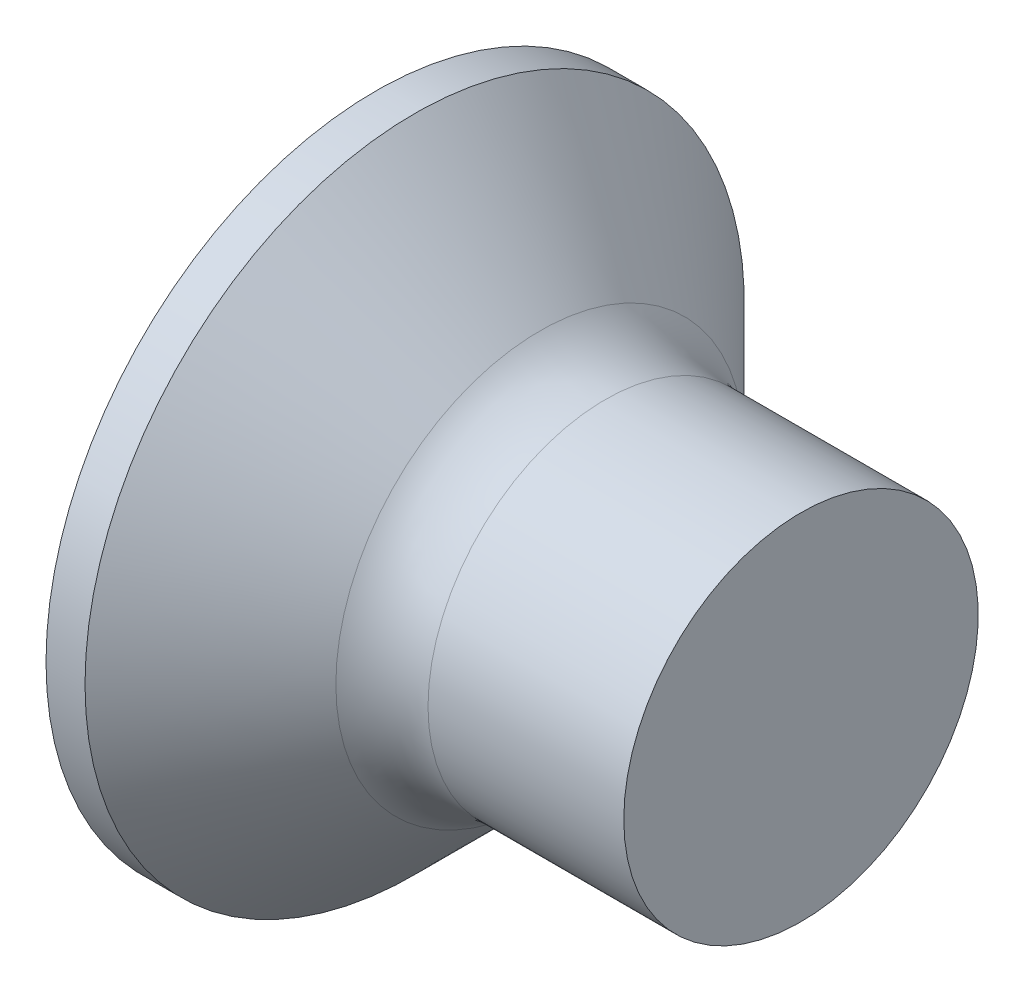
ISO-10303-21;
HEADER;
FILE_DESCRIPTION(('STEP AP214'),'2;1');
FILE_NAME('part.step','',(''),(''),'','','');
FILE_SCHEMA(('AUTOMOTIVE_DESIGN { 1 0 10303 214 1 1 1 1 }'));
ENDSEC;
DATA;
#1=APPLICATION_CONTEXT('core data for automotive mechanical design processes');
#2=APPLICATION_PROTOCOL_DEFINITION('international standard','automotive_design',2000,#1);
#3=PRODUCT_CONTEXT('',#1,'mechanical');
#4=PRODUCT('Part','Part','',(#3));
#5=PRODUCT_RELATED_PRODUCT_CATEGORY('part','',(#4));
#6=PRODUCT_DEFINITION_FORMATION('','',#4);
#7=PRODUCT_DEFINITION_CONTEXT('part definition',#1,'design');
#8=PRODUCT_DEFINITION('design','',#6,#7);
#9=PRODUCT_DEFINITION_SHAPE('','',#8);
#10=(LENGTH_UNIT() NAMED_UNIT(*) SI_UNIT(.MILLI.,.METRE.));
#11=(NAMED_UNIT(*) PLANE_ANGLE_UNIT() SI_UNIT($,.RADIAN.));
#12=(NAMED_UNIT(*) SI_UNIT($,.STERADIAN.) SOLID_ANGLE_UNIT());
#13=UNCERTAINTY_MEASURE_WITH_UNIT(LENGTH_MEASURE(1.E-05),#10,'distance_accuracy_value','');
#14=(GEOMETRIC_REPRESENTATION_CONTEXT(3) GLOBAL_UNCERTAINTY_ASSIGNED_CONTEXT((#13)) GLOBAL_UNIT_ASSIGNED_CONTEXT((#10,
#11,#12)) REPRESENTATION_CONTEXT('',''));
#15=CARTESIAN_POINT('',(0.,0.,0.));
#16=DIRECTION('',(0.,0.,1.));
#17=DIRECTION('',(1.,0.,0.));
#18=AXIS2_PLACEMENT_3D('',#15,#16,#17);
#19=CARTESIAN_POINT('',(0.,0.,0.));
#20=DIRECTION('',(-1.,0.,0.));
#21=DIRECTION('',(0.,0.,1.));
#22=AXIS2_PLACEMENT_3D('',#19,#20,#21);
#23=PLANE('',#22);
#24=CARTESIAN_POINT('',(0.,0.,0.));
#25=DIRECTION('',(-1.,0.,0.));
#26=DIRECTION('',(0.,0.,1.));
#27=AXIS2_PLACEMENT_3D('',#24,#25,#26);
#28=CIRCLE('',#27,4.65);
#29=CARTESIAN_POINT('',(0.,0.,4.65));
#30=VERTEX_POINT('',#29);
#31=EDGE_CURVE('E366',#30,#30,#28,.T.);
#32=ORIENTED_EDGE('',*,*,#31,.T.);
#33=EDGE_LOOP('',(#32));
#34=FACE_BOUND('',#33,.T.);
#35=DIRECTION('',(0.,0.,-1.));
#36=VECTOR('',#35,1.);
#37=CARTESIAN_POINT('',(0.,-0.515000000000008,2.45));
#38=LINE('',#37,#36);
#39=CARTESIAN_POINT('',(0.,-0.515000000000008,2.45));
#40=VERTEX_POINT('',#39);
#41=CARTESIAN_POINT('',(0.,-0.515000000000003,0.931375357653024));
#42=VERTEX_POINT('',#41);
#43=EDGE_CURVE('E304',#40,#42,#38,.T.);
#44=ORIENTED_EDGE('',*,*,#43,.T.);
#45=CARTESIAN_POINT('',(0.,0.,0.));
#46=DIRECTION('',(-1.,0.,0.));
#47=DIRECTION('',(0.,0.,1.));
#48=AXIS2_PLACEMENT_3D('',#45,#46,#47);
#49=CIRCLE('',#48,1.06427677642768);
#50=CARTESIAN_POINT('',(0.,-0.931375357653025,0.515));
#51=VERTEX_POINT('',#50);
#52=EDGE_CURVE('E395',#51,#42,#49,.T.);
#53=ORIENTED_EDGE('',*,*,#52,.F.);
#54=DIRECTION('',(0.,-1.,0.));
#55=VECTOR('',#54,1.);
#56=CARTESIAN_POINT('',(0.,2.45,0.515));
#57=LINE('',#56,#55);
#58=CARTESIAN_POINT('',(0.,-2.45,0.515));
#59=VERTEX_POINT('',#58);
#60=EDGE_CURVE('E330',#51,#59,#57,.T.);
#61=ORIENTED_EDGE('',*,*,#60,.T.);
#62=DIRECTION('',(0.,0.,-1.));
#63=VECTOR('',#62,1.);
#64=CARTESIAN_POINT('',(0.,-2.45,0.515));
#65=LINE('',#64,#63);
#66=CARTESIAN_POINT('',(0.,-2.45,-0.514999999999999));
#67=VERTEX_POINT('',#66);
#68=EDGE_CURVE('E335',#59,#67,#65,.T.);
#69=ORIENTED_EDGE('',*,*,#68,.T.);
#70=DIRECTION('',(0.,1.,0.));
#71=VECTOR('',#70,1.);
#72=CARTESIAN_POINT('',(0.,-2.45,-0.514999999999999));
#73=LINE('',#72,#71);
#74=CARTESIAN_POINT('',(0.,-0.931375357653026,-0.514999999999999));
#75=VERTEX_POINT('',#74);
#76=EDGE_CURVE('E331',#67,#75,#73,.T.);
#77=ORIENTED_EDGE('',*,*,#76,.T.);
#78=CARTESIAN_POINT('',(0.,-0.514999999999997,-0.931375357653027));
#79=VERTEX_POINT('',#78);
#80=EDGE_CURVE('E402',#79,#75,#49,.T.);
#81=ORIENTED_EDGE('',*,*,#80,.F.);
#82=CARTESIAN_POINT('',(0.,-0.514999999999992,-2.45));
#83=VERTEX_POINT('',#82);
#84=EDGE_CURVE('E302',#79,#83,#38,.T.);
#85=ORIENTED_EDGE('',*,*,#84,.T.);
#86=DIRECTION('',(0.,1.,0.));
#87=VECTOR('',#86,1.);
#88=CARTESIAN_POINT('',(0.,-0.514999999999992,-2.45));
#89=LINE('',#88,#87);
#90=CARTESIAN_POINT('',(0.,0.515000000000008,-2.45));
#91=VERTEX_POINT('',#90);
#92=EDGE_CURVE('E284',#83,#91,#89,.T.);
#93=ORIENTED_EDGE('',*,*,#92,.T.);
#94=DIRECTION('',(0.,0.,1.));
#95=VECTOR('',#94,1.);
#96=CARTESIAN_POINT('',(0.,0.515000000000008,-2.45));
#97=LINE('',#96,#95);
#98=CARTESIAN_POINT('',(0.,0.515000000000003,-0.931375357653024));
#99=VERTEX_POINT('',#98);
#100=EDGE_CURVE('E294',#91,#99,#97,.T.);
#101=ORIENTED_EDGE('',*,*,#100,.T.);
#102=CARTESIAN_POINT('',(0.,0.931375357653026,-0.514999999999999));
#103=VERTEX_POINT('',#102);
#104=EDGE_CURVE('E398',#103,#99,#49,.T.);
#105=ORIENTED_EDGE('',*,*,#104,.F.);
#106=CARTESIAN_POINT('',(0.,2.45,-0.514999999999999));
#107=VERTEX_POINT('',#106);
#108=EDGE_CURVE('E341',#103,#107,#73,.T.);
#109=ORIENTED_EDGE('',*,*,#108,.T.);
#110=DIRECTION('',(0.,0.,1.));
#111=VECTOR('',#110,1.);
#112=CARTESIAN_POINT('',(0.,2.45,-0.514999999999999));
#113=LINE('',#112,#111);
#114=CARTESIAN_POINT('',(0.,2.45,0.515));
#115=VERTEX_POINT('',#114);
#116=EDGE_CURVE('E327',#107,#115,#113,.T.);
#117=ORIENTED_EDGE('',*,*,#116,.T.);
#118=CARTESIAN_POINT('',(0.,0.931375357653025,0.515));
#119=VERTEX_POINT('',#118);
#120=EDGE_CURVE('E332',#115,#119,#57,.T.);
#121=ORIENTED_EDGE('',*,*,#120,.T.);
#122=CARTESIAN_POINT('',(0.,0.514999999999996,0.931375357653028));
#123=VERTEX_POINT('',#122);
#124=EDGE_CURVE('E397',#123,#119,#49,.T.);
#125=ORIENTED_EDGE('',*,*,#124,.F.);
#126=CARTESIAN_POINT('',(0.,0.514999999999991,2.45));
#127=VERTEX_POINT('',#126);
#128=EDGE_CURVE('E297',#123,#127,#97,.T.);
#129=ORIENTED_EDGE('',*,*,#128,.T.);
#130=DIRECTION('',(0.,-1.,0.));
#131=VECTOR('',#130,1.);
#132=CARTESIAN_POINT('',(0.,0.514999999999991,2.45));
#133=LINE('',#132,#131);
#134=EDGE_CURVE('E296',#127,#40,#133,.T.);
#135=ORIENTED_EDGE('',*,*,#134,.T.);
#136=EDGE_LOOP('',(#44,#53,#61,#69,#77,#81,#85,#93,#101,#105,#109,#117,#121,#125,#129,#135));
#137=FACE_BOUND('',#136,.T.);
#138=ADVANCED_FACE('F34',(#34,#137),#23,.T.);
#139=CARTESIAN_POINT('',(3.05,-0.929326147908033,0.515));
#140=DIRECTION('',(0.,0.,-1.));
#141=DIRECTION('',(0.,1.,0.));
#142=AXIS2_PLACEMENT_3D('',#139,#140,#141);
#143=PLANE('',#142);
#144=ORIENTED_EDGE('',*,*,#60,.F.);
#145=CARTESIAN_POINT('',(-1.54221347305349,-1.05291860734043,0.515));
#146=CARTESIAN_POINT('',(-1.22007147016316,-1.02783607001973,0.515));
#147=CARTESIAN_POINT('',(-0.897941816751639,-1.002592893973,0.515));
#148=CARTESIAN_POINT('',(-0.253713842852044,-0.951673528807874,0.515));
#149=CARTESIAN_POINT('',(0.0683844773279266,-0.925997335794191,0.515));
#150=CARTESIAN_POINT('',(0.712537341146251,-0.874100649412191,0.515));
#151=CARTESIAN_POINT('',(1.03459188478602,-0.847880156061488,0.515));
#152=CARTESIAN_POINT('',(1.67864013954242,-0.794723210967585,0.515));
#153=CARTESIAN_POINT('',(2.0006338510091,-0.767786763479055,0.515));
#154=CARTESIAN_POINT('',(2.56056239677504,-0.720091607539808,0.515));
#155=CARTESIAN_POINT('',(2.7985160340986,-0.699554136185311,0.515));
#156=CARTESIAN_POINT('',(3.27436149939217,-0.657782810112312,0.515));
#157=CARTESIAN_POINT('',(3.51225332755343,-0.636548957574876,0.515));
#158=CARTESIAN_POINT('',(3.98796007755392,-0.59316517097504,0.515));
#159=CARTESIAN_POINT('',(4.22577499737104,-0.571015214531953,0.515));
#160=CARTESIAN_POINT('',(4.70127802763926,-0.525368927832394,0.515));
#161=CARTESIAN_POINT('',(4.93896613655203,-0.50187258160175,0.515000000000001));
#162=CARTESIAN_POINT('',(5.17656597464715,-0.477487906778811,0.515));
#163=B_SPLINE_CURVE_WITH_KNOTS('',3,(#145,#146,#147,#148,#149,#150,#151,#152,#153,#154,#155,
#156,#157,#158,#159,#160,#161,#162),.UNSPECIFIED.,.F.,.F.,(4,2,2,2,2,2,2,2,4),(0.,
0.9693512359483,1.9387111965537,2.90807112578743,3.87742529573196,4.59393929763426,
5.3104510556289,6.0269803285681,6.74351810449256),.UNSPECIFIED.);
#164=CARTESIAN_POINT('',(3.05,-0.677477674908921,0.515));
#165=VERTEX_POINT('',#164);
#166=EDGE_CURVE('E410',#51,#165,#163,.T.);
#167=ORIENTED_EDGE('',*,*,#166,.T.);
#168=DIRECTION('',(0.,-1.,0.));
#169=VECTOR('',#168,1.);
#170=CARTESIAN_POINT('',(3.05,0.929326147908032,0.515));
#171=LINE('',#170,#169);
#172=CARTESIAN_POINT('',(3.05,-0.929326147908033,0.515));
#173=VERTEX_POINT('',#172);
#174=EDGE_CURVE('E355',#165,#173,#171,.T.);
#175=ORIENTED_EDGE('',*,*,#174,.T.);
#176=DIRECTION('',(0.89493436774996,0.446197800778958,0.));
#177=VECTOR('',#176,1.);
#178=CARTESIAN_POINT('',(0.,-2.45,0.515));
#179=LINE('',#178,#177);
#180=EDGE_CURVE('E342',#59,#173,#179,.T.);
#181=ORIENTED_EDGE('',*,*,#180,.F.);
#182=EDGE_LOOP('',(#144,#167,#175,#181));
#183=FACE_BOUND('',#182,.T.);
#184=ADVANCED_FACE('F166',(#183),#143,.T.);
#185=CARTESIAN_POINT('',(3.05,0.929326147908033,0.515));
#186=VERTEX_POINT('',#185);
#187=CARTESIAN_POINT('',(3.05,0.677477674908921,0.515));
#188=VERTEX_POINT('',#187);
#189=EDGE_CURVE('E356',#186,#188,#171,.T.);
#190=ORIENTED_EDGE('',*,*,#189,.T.);
#191=CARTESIAN_POINT('',(-1.54221347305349,1.05291860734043,0.515));
#192=CARTESIAN_POINT('',(-1.22007147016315,1.02783607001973,0.515));
#193=CARTESIAN_POINT('',(-0.897941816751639,1.002592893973,0.515));
#194=CARTESIAN_POINT('',(-0.253713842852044,0.951673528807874,0.515));
#195=CARTESIAN_POINT('',(0.068384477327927,0.925997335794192,0.515));
#196=CARTESIAN_POINT('',(0.712537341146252,0.874100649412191,0.515));
#197=CARTESIAN_POINT('',(1.03459188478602,0.847880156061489,0.515));
#198=CARTESIAN_POINT('',(1.67864013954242,0.794723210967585,0.515));
#199=CARTESIAN_POINT('',(2.0006338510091,0.767786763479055,0.515));
#200=CARTESIAN_POINT('',(2.56056239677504,0.720091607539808,0.515));
#201=CARTESIAN_POINT('',(2.7985160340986,0.699554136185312,0.515));
#202=CARTESIAN_POINT('',(3.27436149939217,0.657782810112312,0.515));
#203=CARTESIAN_POINT('',(3.51225332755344,0.636548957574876,0.515));
#204=CARTESIAN_POINT('',(3.98796007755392,0.59316517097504,0.515));
#205=CARTESIAN_POINT('',(4.22577499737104,0.571015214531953,0.515));
#206=CARTESIAN_POINT('',(4.70127802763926,0.525368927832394,0.515));
#207=CARTESIAN_POINT('',(4.93896613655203,0.50187258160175,0.515));
#208=CARTESIAN_POINT('',(5.17656597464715,0.477487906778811,0.515));
#209=B_SPLINE_CURVE_WITH_KNOTS('',3,(#191,#192,#193,#194,#195,#196,#197,#198,#199,#200,#201,
#202,#203,#204,#205,#206,#207,#208),.UNSPECIFIED.,.F.,.F.,(4,2,2,2,2,2,2,2,4),(0.,
0.9693512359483,1.9387111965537,2.90807112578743,3.87742529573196,4.59393929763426,
5.3104510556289,6.0269803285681,6.74351810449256),.UNSPECIFIED.);
#210=EDGE_CURVE('E226',#188,#119,#209,.F.);
#211=ORIENTED_EDGE('',*,*,#210,.T.);
#212=ORIENTED_EDGE('',*,*,#120,.F.);
#213=DIRECTION('',(0.89493436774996,-0.446197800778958,0.));
#214=VECTOR('',#213,1.);
#215=CARTESIAN_POINT('',(0.,2.45,0.515));
#216=LINE('',#215,#214);
#217=EDGE_CURVE('E62',#115,#186,#216,.T.);
#218=ORIENTED_EDGE('',*,*,#217,.T.);
#219=EDGE_LOOP('',(#190,#211,#212,#218));
#220=FACE_BOUND('',#219,.T.);
#221=ADVANCED_FACE('F171',(#220),#143,.T.);
#222=CARTESIAN_POINT('',(3.05,0.929326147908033,-0.515));
#223=DIRECTION('',(0.,0.,1.));
#224=DIRECTION('',(1.,0.,0.));
#225=AXIS2_PLACEMENT_3D('',#222,#223,#224);
#226=PLANE('',#225);
#227=DIRECTION('',(0.,1.,0.));
#228=VECTOR('',#227,1.);
#229=CARTESIAN_POINT('',(3.05,-0.929326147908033,-0.515));
#230=LINE('',#229,#228);
#231=CARTESIAN_POINT('',(3.05,-0.929326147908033,-0.515));
#232=VERTEX_POINT('',#231);
#233=CARTESIAN_POINT('',(3.05,-0.677477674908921,-0.515));
#234=VERTEX_POINT('',#233);
#235=EDGE_CURVE('E306',#232,#234,#230,.T.);
#236=ORIENTED_EDGE('',*,*,#235,.T.);
#237=CARTESIAN_POINT('',(-1.54221347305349,-1.05291860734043,-0.514999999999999));
#238=CARTESIAN_POINT('',(-1.22007147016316,-1.02783607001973,-0.514999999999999));
#239=CARTESIAN_POINT('',(-0.897941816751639,-1.002592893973,-0.514999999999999));
#240=CARTESIAN_POINT('',(-0.253713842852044,-0.951673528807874,-0.514999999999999));
#241=CARTESIAN_POINT('',(0.0683844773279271,-0.925997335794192,-0.514999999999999));
#242=CARTESIAN_POINT('',(0.712537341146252,-0.874100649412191,-0.515));
#243=CARTESIAN_POINT('',(1.03459188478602,-0.847880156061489,-0.515));
#244=CARTESIAN_POINT('',(1.67864013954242,-0.794723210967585,-0.515));
#245=CARTESIAN_POINT('',(2.0006338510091,-0.767786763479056,-0.515));
#246=CARTESIAN_POINT('',(2.56056239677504,-0.720091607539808,-0.515));
#247=CARTESIAN_POINT('',(2.7985160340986,-0.699554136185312,-0.515));
#248=CARTESIAN_POINT('',(3.27436149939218,-0.657782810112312,-0.515));
#249=CARTESIAN_POINT('',(3.51225332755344,-0.636548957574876,-0.515));
#250=CARTESIAN_POINT('',(3.98796007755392,-0.59316517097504,-0.515));
#251=CARTESIAN_POINT('',(4.22577499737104,-0.571015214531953,-0.515));
#252=CARTESIAN_POINT('',(4.70127802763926,-0.525368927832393,-0.515));
#253=CARTESIAN_POINT('',(4.93896613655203,-0.50187258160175,-0.515));
#254=CARTESIAN_POINT('',(5.17656597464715,-0.477487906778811,-0.515));
#255=B_SPLINE_CURVE_WITH_KNOTS('',3,(#237,#238,#239,#240,#241,#242,#243,#244,#245,#246,#247,
#248,#249,#250,#251,#252,#253,#254),.UNSPECIFIED.,.F.,.F.,(4,2,2,2,2,2,2,2,4),(0.,
0.9693512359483,1.9387111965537,2.90807112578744,3.87742529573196,4.59393929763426,
5.3104510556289,6.0269803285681,6.74351810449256),.UNSPECIFIED.);
#256=EDGE_CURVE('E220',#234,#75,#255,.F.);
#257=ORIENTED_EDGE('',*,*,#256,.T.);
#258=ORIENTED_EDGE('',*,*,#76,.F.);
#259=DIRECTION('',(0.89493436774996,0.446197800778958,0.));
#260=VECTOR('',#259,1.);
#261=CARTESIAN_POINT('',(0.,-2.45,-0.514999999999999));
#262=LINE('',#261,#260);
#263=EDGE_CURVE('E345',#67,#232,#262,.T.);
#264=ORIENTED_EDGE('',*,*,#263,.T.);
#265=EDGE_LOOP('',(#236,#257,#258,#264));
#266=FACE_BOUND('',#265,.T.);
#267=ADVANCED_FACE('F206',(#266),#226,.T.);
#268=ORIENTED_EDGE('',*,*,#108,.F.);
#269=CARTESIAN_POINT('',(-1.54221347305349,1.05291860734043,-0.514999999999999));
#270=CARTESIAN_POINT('',(-1.22007147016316,1.02783607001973,-0.514999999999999));
#271=CARTESIAN_POINT('',(-0.897941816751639,1.002592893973,-0.514999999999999));
#272=CARTESIAN_POINT('',(-0.253713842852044,0.951673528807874,-0.514999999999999));
#273=CARTESIAN_POINT('',(0.0683844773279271,0.925997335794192,-0.514999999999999));
#274=CARTESIAN_POINT('',(0.712537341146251,0.874100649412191,-0.515));
#275=CARTESIAN_POINT('',(1.03459188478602,0.847880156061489,-0.515));
#276=CARTESIAN_POINT('',(1.67864013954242,0.794723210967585,-0.515));
#277=CARTESIAN_POINT('',(2.0006338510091,0.767786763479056,-0.515));
#278=CARTESIAN_POINT('',(2.56056239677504,0.720091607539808,-0.515));
#279=CARTESIAN_POINT('',(2.7985160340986,0.699554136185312,-0.515));
#280=CARTESIAN_POINT('',(3.27436149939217,0.657782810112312,-0.515));
#281=CARTESIAN_POINT('',(3.51225332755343,0.636548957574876,-0.515));
#282=CARTESIAN_POINT('',(3.98796007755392,0.59316517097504,-0.515));
#283=CARTESIAN_POINT('',(4.22577499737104,0.571015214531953,-0.515));
#284=CARTESIAN_POINT('',(4.70127802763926,0.525368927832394,-0.515));
#285=CARTESIAN_POINT('',(4.93896613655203,0.50187258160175,-0.515));
#286=CARTESIAN_POINT('',(5.17656597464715,0.477487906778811,-0.515));
#287=B_SPLINE_CURVE_WITH_KNOTS('',3,(#269,#270,#271,#272,#273,#274,#275,#276,#277,#278,#279,
#280,#281,#282,#283,#284,#285,#286),.UNSPECIFIED.,.F.,.F.,(4,2,2,2,2,2,2,2,4),(0.,
0.9693512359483,1.9387111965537,2.90807112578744,3.87742529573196,4.59393929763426,
5.3104510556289,6.0269803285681,6.74351810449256),.UNSPECIFIED.);
#288=CARTESIAN_POINT('',(3.05,0.677477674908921,-0.515));
#289=VERTEX_POINT('',#288);
#290=EDGE_CURVE('E214',#103,#289,#287,.T.);
#291=ORIENTED_EDGE('',*,*,#290,.T.);
#292=CARTESIAN_POINT('',(3.05,0.929326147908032,-0.515));
#293=VERTEX_POINT('',#292);
#294=EDGE_CURVE('E303',#289,#293,#230,.T.);
#295=ORIENTED_EDGE('',*,*,#294,.T.);
#296=DIRECTION('',(0.89493436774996,-0.446197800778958,0.));
#297=VECTOR('',#296,1.);
#298=CARTESIAN_POINT('',(0.,2.45,-0.514999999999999));
#299=LINE('',#298,#297);
#300=EDGE_CURVE('E349',#107,#293,#299,.T.);
#301=ORIENTED_EDGE('',*,*,#300,.F.);
#302=EDGE_LOOP('',(#268,#291,#295,#301));
#303=FACE_BOUND('',#302,.T.);
#304=ADVANCED_FACE('F198',(#303),#226,.T.);
#305=CARTESIAN_POINT('',(3.05,0.929326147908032,-0.515));
#306=DIRECTION('',(1.,0.,0.));
#307=DIRECTION('',(0.,0.,-1.));
#308=AXIS2_PLACEMENT_3D('',#305,#306,#307);
#309=PLANE('',#308);
#310=CARTESIAN_POINT('',(3.05,0.,0.));
#311=DIRECTION('',(-1.,0.,0.));
#312=DIRECTION('',(0.,0.,1.));
#313=AXIS2_PLACEMENT_3D('',#310,#311,#312);
#314=CIRCLE('',#313,0.850999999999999);
#315=EDGE_CURVE('E386',#234,#165,#314,.T.);
#316=ORIENTED_EDGE('',*,*,#315,.F.);
#317=ORIENTED_EDGE('',*,*,#235,.F.);
#318=DIRECTION('',(0.,0.,-1.));
#319=VECTOR('',#318,1.);
#320=CARTESIAN_POINT('',(3.05,-0.929326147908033,0.515));
#321=LINE('',#320,#319);
#322=EDGE_CURVE('E352',#173,#232,#321,.T.);
#323=ORIENTED_EDGE('',*,*,#322,.F.);
#324=ORIENTED_EDGE('',*,*,#174,.F.);
#325=EDGE_LOOP('',(#316,#317,#323,#324));
#326=FACE_BOUND('',#325,.T.);
#327=ADVANCED_FACE('F194',(#326),#309,.F.);
#328=CARTESIAN_POINT('',(3.05,-0.515000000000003,0.677477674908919));
#329=VERTEX_POINT('',#328);
#330=CARTESIAN_POINT('',(3.05,0.514999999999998,0.677477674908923));
#331=VERTEX_POINT('',#330);
#332=EDGE_CURVE('E394',#329,#331,#314,.T.);
#333=ORIENTED_EDGE('',*,*,#332,.F.);
#334=DIRECTION('',(0.,0.,-1.));
#335=VECTOR('',#334,1.);
#336=CARTESIAN_POINT('',(3.05,-0.515000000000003,0.929326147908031));
#337=LINE('',#336,#335);
#338=CARTESIAN_POINT('',(3.05,-0.515000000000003,0.929326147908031));
#339=VERTEX_POINT('',#338);
#340=EDGE_CURVE('E321',#339,#329,#337,.T.);
#341=ORIENTED_EDGE('',*,*,#340,.F.);
#342=DIRECTION('',(0.,-1.,0.));
#343=VECTOR('',#342,1.);
#344=CARTESIAN_POINT('',(3.05,0.514999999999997,0.929326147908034));
#345=LINE('',#344,#343);
#346=CARTESIAN_POINT('',(3.05,0.514999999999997,0.929326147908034));
#347=VERTEX_POINT('',#346);
#348=EDGE_CURVE('E316',#347,#339,#345,.T.);
#349=ORIENTED_EDGE('',*,*,#348,.F.);
#350=DIRECTION('',(0.,0.,1.));
#351=VECTOR('',#350,1.);
#352=CARTESIAN_POINT('',(3.05,0.515000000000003,-0.929326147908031));
#353=LINE('',#352,#351);
#354=EDGE_CURVE('E326',#331,#347,#353,.T.);
#355=ORIENTED_EDGE('',*,*,#354,.F.);
#356=EDGE_LOOP('',(#333,#341,#349,#355));
#357=FACE_BOUND('',#356,.T.);
#358=ADVANCED_FACE('F197',(#357),#309,.F.);
#359=EDGE_CURVE('E396',#188,#289,#314,.T.);
#360=ORIENTED_EDGE('',*,*,#359,.F.);
#361=ORIENTED_EDGE('',*,*,#189,.F.);
#362=DIRECTION('',(0.,0.,1.));
#363=VECTOR('',#362,1.);
#364=CARTESIAN_POINT('',(3.05,0.929326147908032,-0.515));
#365=LINE('',#364,#363);
#366=EDGE_CURVE('E353',#293,#186,#365,.T.);
#367=ORIENTED_EDGE('',*,*,#366,.F.);
#368=ORIENTED_EDGE('',*,*,#294,.F.);
#369=EDGE_LOOP('',(#360,#361,#367,#368));
#370=FACE_BOUND('',#369,.T.);
#371=ADVANCED_FACE('F426',(#370),#309,.F.);
#372=CARTESIAN_POINT('',(3.05,0.515000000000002,-0.677477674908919));
#373=VERTEX_POINT('',#372);
#374=CARTESIAN_POINT('',(3.05,-0.514999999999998,-0.677477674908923));
#375=VERTEX_POINT('',#374);
#376=EDGE_CURVE('E393',#373,#375,#314,.T.);
#377=ORIENTED_EDGE('',*,*,#376,.F.);
#378=CARTESIAN_POINT('',(3.05,0.515000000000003,-0.929326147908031));
#379=VERTEX_POINT('',#378);
#380=EDGE_CURVE('E320',#379,#373,#353,.T.);
#381=ORIENTED_EDGE('',*,*,#380,.F.);
#382=DIRECTION('',(0.,1.,0.));
#383=VECTOR('',#382,1.);
#384=CARTESIAN_POINT('',(3.05,-0.514999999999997,-0.929326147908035));
#385=LINE('',#384,#383);
#386=CARTESIAN_POINT('',(3.05,-0.514999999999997,-0.929326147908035));
#387=VERTEX_POINT('',#386);
#388=EDGE_CURVE('E287',#387,#379,#385,.T.);
#389=ORIENTED_EDGE('',*,*,#388,.F.);
#390=EDGE_CURVE('E319',#375,#387,#337,.T.);
#391=ORIENTED_EDGE('',*,*,#390,.F.);
#392=EDGE_LOOP('',(#377,#381,#389,#391));
#393=FACE_BOUND('',#392,.T.);
#394=ADVANCED_FACE('F200',(#393),#309,.F.);
#395=CARTESIAN_POINT('',(3.05,0.514999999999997,0.929326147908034));
#396=DIRECTION('',(0.,-1.,0.));
#397=DIRECTION('',(1.,0.,0.));
#398=AXIS2_PLACEMENT_3D('',#395,#396,#397);
#399=PLANE('',#398);
#400=ORIENTED_EDGE('',*,*,#380,.T.);
#401=CARTESIAN_POINT('',(-1.54221347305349,0.515000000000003,-1.05291860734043));
#402=CARTESIAN_POINT('',(-1.22007147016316,0.515000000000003,-1.02783607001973));
#403=CARTESIAN_POINT('',(-0.897941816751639,0.515000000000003,-1.002592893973));
#404=CARTESIAN_POINT('',(-0.253713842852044,0.515000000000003,-0.951673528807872));
#405=CARTESIAN_POINT('',(0.0683844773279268,0.515000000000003,-0.92599733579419));
#406=CARTESIAN_POINT('',(0.712537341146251,0.515000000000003,-0.874100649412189));
#407=CARTESIAN_POINT('',(1.03459188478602,0.515000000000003,-0.847880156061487));
#408=CARTESIAN_POINT('',(1.67864013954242,0.515000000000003,-0.794723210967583));
#409=CARTESIAN_POINT('',(2.0006338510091,0.515000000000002,-0.767786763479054));
#410=CARTESIAN_POINT('',(2.56056239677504,0.515000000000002,-0.720091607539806));
#411=CARTESIAN_POINT('',(2.7985160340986,0.515000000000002,-0.69955413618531));
#412=CARTESIAN_POINT('',(3.27436149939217,0.515000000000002,-0.657782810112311));
#413=CARTESIAN_POINT('',(3.51225332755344,0.515000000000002,-0.636548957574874));
#414=CARTESIAN_POINT('',(3.98796007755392,0.515000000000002,-0.593165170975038));
#415=CARTESIAN_POINT('',(4.22577499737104,0.515000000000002,-0.571015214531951));
#416=CARTESIAN_POINT('',(4.70127802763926,0.515000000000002,-0.525368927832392));
#417=CARTESIAN_POINT('',(4.93896613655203,0.515000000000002,-0.501872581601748));
#418=CARTESIAN_POINT('',(5.17656597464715,0.515000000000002,-0.477487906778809));
#419=B_SPLINE_CURVE_WITH_KNOTS('',3,(#401,#402,#403,#404,#405,#406,#407,#408,#409,#410,#411,
#412,#413,#414,#415,#416,#417,#418),.UNSPECIFIED.,.F.,.F.,(4,2,2,2,2,2,2,2,4),(0.,
0.9693512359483,1.9387111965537,2.90807112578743,3.87742529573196,4.59393929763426,
5.3104510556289,6.0269803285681,6.74351810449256),.UNSPECIFIED.);
#420=EDGE_CURVE('E251',#373,#99,#419,.F.);
#421=ORIENTED_EDGE('',*,*,#420,.T.);
#422=ORIENTED_EDGE('',*,*,#100,.F.);
#423=DIRECTION('',(0.89493436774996,0.,0.446197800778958));
#424=VECTOR('',#423,1.);
#425=CARTESIAN_POINT('',(0.,0.515000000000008,-2.45));
#426=LINE('',#425,#424);
#427=EDGE_CURVE('E280',#91,#379,#426,.T.);
#428=ORIENTED_EDGE('',*,*,#427,.T.);
#429=EDGE_LOOP('',(#400,#421,#422,#428));
#430=FACE_BOUND('',#429,.T.);
#431=ADVANCED_FACE('F257',(#430),#399,.T.);
#432=CARTESIAN_POINT('',(3.05,-0.514999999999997,-0.929326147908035));
#433=DIRECTION('',(0.,1.,0.));
#434=DIRECTION('',(0.,0.,1.));
#435=AXIS2_PLACEMENT_3D('',#432,#433,#434);
#436=PLANE('',#435);
#437=ORIENTED_EDGE('',*,*,#84,.F.);
#438=CARTESIAN_POINT('',(-1.54221347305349,-0.514999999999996,-1.05291860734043));
#439=CARTESIAN_POINT('',(-1.22007147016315,-0.514999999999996,-1.02783607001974));
#440=CARTESIAN_POINT('',(-0.897941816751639,-0.514999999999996,-1.002592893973));
#441=CARTESIAN_POINT('',(-0.253713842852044,-0.514999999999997,-0.951673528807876));
#442=CARTESIAN_POINT('',(0.0683844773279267,-0.514999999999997,-0.925997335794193));
#443=CARTESIAN_POINT('',(0.712537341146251,-0.514999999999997,-0.874100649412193));
#444=CARTESIAN_POINT('',(1.03459188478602,-0.514999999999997,-0.84788015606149));
#445=CARTESIAN_POINT('',(1.67864013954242,-0.514999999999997,-0.794723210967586));
#446=CARTESIAN_POINT('',(2.0006338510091,-0.514999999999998,-0.767786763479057));
#447=CARTESIAN_POINT('',(2.56056239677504,-0.514999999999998,-0.72009160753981));
#448=CARTESIAN_POINT('',(2.7985160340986,-0.514999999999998,-0.699554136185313));
#449=CARTESIAN_POINT('',(3.27436149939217,-0.514999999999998,-0.657782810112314));
#450=CARTESIAN_POINT('',(3.51225332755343,-0.514999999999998,-0.636548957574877));
#451=CARTESIAN_POINT('',(3.98796007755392,-0.514999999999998,-0.593165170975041));
#452=CARTESIAN_POINT('',(4.22577499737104,-0.514999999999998,-0.571015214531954));
#453=CARTESIAN_POINT('',(4.70127802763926,-0.514999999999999,-0.525368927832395));
#454=CARTESIAN_POINT('',(4.93896613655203,-0.514999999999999,-0.501872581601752));
#455=CARTESIAN_POINT('',(5.17656597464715,-0.514999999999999,-0.477487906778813));
#456=B_SPLINE_CURVE_WITH_KNOTS('',3,(#438,#439,#440,#441,#442,#443,#444,#445,#446,#447,#448,
#449,#450,#451,#452,#453,#454,#455),.UNSPECIFIED.,.F.,.F.,(4,2,2,2,2,2,2,2,4),(0.,
0.9693512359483,1.9387111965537,2.90807112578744,3.87742529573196,4.59393929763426,
5.3104510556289,6.0269803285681,6.74351810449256),.UNSPECIFIED.);
#457=EDGE_CURVE('E246',#79,#375,#456,.T.);
#458=ORIENTED_EDGE('',*,*,#457,.T.);
#459=ORIENTED_EDGE('',*,*,#390,.T.);
#460=DIRECTION('',(0.89493436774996,0.,0.446197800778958));
#461=VECTOR('',#460,1.);
#462=CARTESIAN_POINT('',(0.,-0.514999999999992,-2.45));
#463=LINE('',#462,#461);
#464=EDGE_CURVE('E290',#83,#387,#463,.T.);
#465=ORIENTED_EDGE('',*,*,#464,.F.);
#466=EDGE_LOOP('',(#437,#458,#459,#465));
#467=FACE_BOUND('',#466,.T.);
#468=ADVANCED_FACE('F261',(#467),#436,.T.);
#469=ORIENTED_EDGE('',*,*,#340,.T.);
#470=CARTESIAN_POINT('',(-1.54221347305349,-0.515000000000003,1.05291860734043));
#471=CARTESIAN_POINT('',(-1.22007147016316,-0.515000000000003,1.02783607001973));
#472=CARTESIAN_POINT('',(-0.897941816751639,-0.515000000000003,1.002592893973));
#473=CARTESIAN_POINT('',(-0.253713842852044,-0.515000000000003,0.951673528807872));
#474=CARTESIAN_POINT('',(0.0683844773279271,-0.515000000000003,0.92599733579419));
#475=CARTESIAN_POINT('',(0.712537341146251,-0.515000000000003,0.874100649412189));
#476=CARTESIAN_POINT('',(1.03459188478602,-0.515000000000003,0.847880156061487));
#477=CARTESIAN_POINT('',(1.67864013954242,-0.515000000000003,0.794723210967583));
#478=CARTESIAN_POINT('',(2.0006338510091,-0.515000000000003,0.767786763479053));
#479=CARTESIAN_POINT('',(2.56056239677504,-0.515000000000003,0.720091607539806));
#480=CARTESIAN_POINT('',(2.7985160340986,-0.515000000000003,0.69955413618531));
#481=CARTESIAN_POINT('',(3.27436149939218,-0.515000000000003,0.65778281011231));
#482=CARTESIAN_POINT('',(3.51225332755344,-0.515000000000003,0.636548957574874));
#483=CARTESIAN_POINT('',(3.98796007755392,-0.515000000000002,0.593165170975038));
#484=CARTESIAN_POINT('',(4.22577499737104,-0.515000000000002,0.571015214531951));
#485=CARTESIAN_POINT('',(4.70127802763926,-0.515000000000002,0.525368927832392));
#486=CARTESIAN_POINT('',(4.93896613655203,-0.515000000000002,0.501872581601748));
#487=CARTESIAN_POINT('',(5.17656597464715,-0.515000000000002,0.47748790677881));
#488=B_SPLINE_CURVE_WITH_KNOTS('',3,(#470,#471,#472,#473,#474,#475,#476,#477,#478,#479,#480,
#481,#482,#483,#484,#485,#486,#487),.UNSPECIFIED.,.F.,.F.,(4,2,2,2,2,2,2,2,4),(0.,
0.969351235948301,1.9387111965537,2.90807112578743,3.87742529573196,4.59393929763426,
5.3104510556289,6.0269803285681,6.74351810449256),.UNSPECIFIED.);
#489=EDGE_CURVE('E239',#329,#42,#488,.F.);
#490=ORIENTED_EDGE('',*,*,#489,.T.);
#491=ORIENTED_EDGE('',*,*,#43,.F.);
#492=DIRECTION('',(0.89493436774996,0.,-0.446197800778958));
#493=VECTOR('',#492,1.);
#494=CARTESIAN_POINT('',(0.,-0.515000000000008,2.45));
#495=LINE('',#494,#493);
#496=EDGE_CURVE('E291',#40,#339,#495,.T.);
#497=ORIENTED_EDGE('',*,*,#496,.T.);
#498=EDGE_LOOP('',(#469,#490,#491,#497));
#499=FACE_BOUND('',#498,.T.);
#500=ADVANCED_FACE('F448',(#499),#436,.T.);
#501=ORIENTED_EDGE('',*,*,#128,.F.);
#502=CARTESIAN_POINT('',(-1.54221347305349,0.514999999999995,1.05291860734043));
#503=CARTESIAN_POINT('',(-1.22007147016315,0.514999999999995,1.02783607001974));
#504=CARTESIAN_POINT('',(-0.897941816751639,0.514999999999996,1.002592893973));
#505=CARTESIAN_POINT('',(-0.253713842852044,0.514999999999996,0.951673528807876));
#506=CARTESIAN_POINT('',(0.068384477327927,0.514999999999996,0.925997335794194));
#507=CARTESIAN_POINT('',(0.712537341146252,0.514999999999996,0.874100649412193));
#508=CARTESIAN_POINT('',(1.03459188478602,0.514999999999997,0.847880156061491));
#509=CARTESIAN_POINT('',(1.67864013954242,0.514999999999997,0.794723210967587));
#510=CARTESIAN_POINT('',(2.0006338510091,0.514999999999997,0.767786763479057));
#511=CARTESIAN_POINT('',(2.56056239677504,0.514999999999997,0.72009160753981));
#512=CARTESIAN_POINT('',(2.7985160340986,0.514999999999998,0.699554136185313));
#513=CARTESIAN_POINT('',(3.27436149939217,0.514999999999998,0.657782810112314));
#514=CARTESIAN_POINT('',(3.51225332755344,0.514999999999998,0.636548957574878));
#515=CARTESIAN_POINT('',(3.98796007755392,0.514999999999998,0.593165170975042));
#516=CARTESIAN_POINT('',(4.22577499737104,0.514999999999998,0.571015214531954));
#517=CARTESIAN_POINT('',(4.70127802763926,0.514999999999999,0.525368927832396));
#518=CARTESIAN_POINT('',(4.93896613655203,0.514999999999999,0.501872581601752));
#519=CARTESIAN_POINT('',(5.17656597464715,0.514999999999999,0.477487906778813));
#520=B_SPLINE_CURVE_WITH_KNOTS('',3,(#502,#503,#504,#505,#506,#507,#508,#509,#510,#511,#512,
#513,#514,#515,#516,#517,#518,#519),.UNSPECIFIED.,.F.,.F.,(4,2,2,2,2,2,2,2,4),(0.,
0.9693512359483,1.9387111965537,2.90807112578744,3.87742529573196,4.59393929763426,
5.3104510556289,6.0269803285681,6.74351810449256),.UNSPECIFIED.);
#521=EDGE_CURVE('E11',#123,#331,#520,.T.);
#522=ORIENTED_EDGE('',*,*,#521,.T.);
#523=ORIENTED_EDGE('',*,*,#354,.T.);
#524=DIRECTION('',(0.89493436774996,0.,-0.446197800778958));
#525=VECTOR('',#524,1.);
#526=CARTESIAN_POINT('',(0.,0.514999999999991,2.45));
#527=LINE('',#526,#525);
#528=EDGE_CURVE('E313',#127,#347,#527,.T.);
#529=ORIENTED_EDGE('',*,*,#528,.F.);
#530=EDGE_LOOP('',(#501,#522,#523,#529));
#531=FACE_BOUND('',#530,.T.);
#532=ADVANCED_FACE('F181',(#531),#399,.T.);
#533=CARTESIAN_POINT('',(-6.34999999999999,0.,0.));
#534=DIRECTION('',(-1.,0.,0.));
#535=DIRECTION('',(0.,0.,1.));
#536=AXIS2_PLACEMENT_3D('',#533,#534,#535);
#537=CYLINDRICAL_SURFACE('',#536,4.65);
#538=CARTESIAN_POINT('',(0.550000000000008,0.,0.));
#539=DIRECTION('',(-1.,0.,0.));
#540=DIRECTION('',(0.,0.,1.));
#541=AXIS2_PLACEMENT_3D('',#538,#539,#540);
#542=CIRCLE('',#541,4.65);
#543=CARTESIAN_POINT('',(0.550000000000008,0.,4.65));
#544=VERTEX_POINT('',#543);
#545=EDGE_CURVE('E363',#544,#544,#542,.T.);
#546=ORIENTED_EDGE('',*,*,#545,.T.);
#547=EDGE_LOOP('',(#546));
#548=FACE_BOUND('',#547,.T.);
#549=ORIENTED_EDGE('',*,*,#31,.F.);
#550=EDGE_LOOP('',(#549));
#551=FACE_BOUND('',#550,.T.);
#552=ADVANCED_FACE('F177',(#548,#551),#537,.T.);
#553=CARTESIAN_POINT('',(0.550000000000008,0.,0.));
#554=DIRECTION('',(-1.,0.,0.));
#555=DIRECTION('',(0.,0.,1.));
#556=AXIS2_PLACEMENT_3D('',#553,#554,#555);
#557=CONICAL_SURFACE('',#556,4.65,0.78539816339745);
#558=CARTESIAN_POINT('',(2.31923881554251,0.,0.));
#559=DIRECTION('',(-1.,0.,0.));
#560=DIRECTION('',(0.,0.,1.));
#561=AXIS2_PLACEMENT_3D('',#558,#559,#560);
#562=CIRCLE('',#561,2.88076118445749);
#563=CARTESIAN_POINT('',(2.31923881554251,0.,2.88076118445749));
#564=VERTEX_POINT('',#563);
#565=EDGE_CURVE('E368',#564,#564,#562,.T.);
#566=ORIENTED_EDGE('',*,*,#565,.T.);
#567=EDGE_LOOP('',(#566));
#568=FACE_BOUND('',#567,.T.);
#569=ORIENTED_EDGE('',*,*,#545,.F.);
#570=EDGE_LOOP('',(#569));
#571=FACE_BOUND('',#570,.T.);
#572=ADVANCED_FACE('F180',(#568,#571),#557,.T.);
#573=CARTESIAN_POINT('',(-6.34999999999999,0.,0.));
#574=DIRECTION('',(-1.,0.,0.));
#575=DIRECTION('',(0.,0.,1.));
#576=AXIS2_PLACEMENT_3D('',#573,#574,#575);
#577=CYLINDRICAL_SURFACE('',#576,2.5);
#578=CARTESIAN_POINT('',(3.23847763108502,0.,0.));
#579=DIRECTION('',(-1.,0.,0.));
#580=DIRECTION('',(0.,0.,1.));
#581=AXIS2_PLACEMENT_3D('',#578,#579,#580);
#582=CIRCLE('',#581,2.5);
#583=CARTESIAN_POINT('',(3.23847763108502,0.,2.5));
#584=VERTEX_POINT('',#583);
#585=EDGE_CURVE('E47',#584,#584,#582,.F.);
#586=ORIENTED_EDGE('',*,*,#585,.T.);
#587=EDGE_LOOP('',(#586));
#588=FACE_BOUND('',#587,.T.);
#589=CARTESIAN_POINT('',(6.,0.,0.));
#590=DIRECTION('',(-1.,0.,0.));
#591=DIRECTION('',(0.,0.,1.));
#592=AXIS2_PLACEMENT_3D('',#589,#590,#591);
#593=CIRCLE('',#592,2.5);
#594=CARTESIAN_POINT('',(6.,0.,2.5));
#595=VERTEX_POINT('',#594);
#596=EDGE_CURVE('E338',#595,#595,#593,.T.);
#597=ORIENTED_EDGE('',*,*,#596,.T.);
#598=EDGE_LOOP('',(#597));
#599=FACE_BOUND('',#598,.T.);
#600=ADVANCED_FACE('F185',(#588,#599),#577,.T.);
#601=CARTESIAN_POINT('',(6.,2.5,0.));
#602=DIRECTION('',(1.,0.,0.));
#603=DIRECTION('',(0.,0.,-1.));
#604=AXIS2_PLACEMENT_3D('',#601,#602,#603);
#605=PLANE('',#604);
#606=ORIENTED_EDGE('',*,*,#596,.F.);
#607=EDGE_LOOP('',(#606));
#608=FACE_BOUND('',#607,.T.);
#609=ADVANCED_FACE('F189',(#608),#605,.T.);
#610=CARTESIAN_POINT('',(3.23847763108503,0.,0.));
#611=DIRECTION('',(-1.,0.,0.));
#612=DIRECTION('',(0.,0.,1.));
#613=AXIS2_PLACEMENT_3D('',#610,#611,#612);
#614=TOROIDAL_SURFACE('',#613,3.8,1.3);
#615=ORIENTED_EDGE('',*,*,#585,.F.);
#616=EDGE_LOOP('',(#615));
#617=FACE_BOUND('',#616,.T.);
#618=ORIENTED_EDGE('',*,*,#565,.F.);
#619=EDGE_LOOP('',(#618));
#620=FACE_BOUND('',#619,.T.);
#621=ADVANCED_FACE('F36',(#617,#620),#614,.F.);
#622=CARTESIAN_POINT('',(3.05,-0.929326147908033,-0.515));
#623=DIRECTION('',(-0.446197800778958,0.89493436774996,0.));
#624=DIRECTION('',(-0.89493436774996,-0.446197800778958,0.));
#625=AXIS2_PLACEMENT_3D('',#622,#623,#624);
#626=PLANE('',#625);
#627=ORIENTED_EDGE('',*,*,#263,.F.);
#628=ORIENTED_EDGE('',*,*,#68,.F.);
#629=ORIENTED_EDGE('',*,*,#180,.T.);
#630=ORIENTED_EDGE('',*,*,#322,.T.);
#631=EDGE_LOOP('',(#627,#628,#629,#630));
#632=FACE_BOUND('',#631,.T.);
#633=ADVANCED_FACE('F205',(#632),#626,.T.);
#634=CARTESIAN_POINT('',(3.05,0.929326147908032,0.515));
#635=DIRECTION('',(-0.446197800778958,-0.894934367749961,0.));
#636=DIRECTION('',(0.89493436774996,-0.446197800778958,0.));
#637=AXIS2_PLACEMENT_3D('',#634,#635,#636);
#638=PLANE('',#637);
#639=ORIENTED_EDGE('',*,*,#217,.F.);
#640=ORIENTED_EDGE('',*,*,#116,.F.);
#641=ORIENTED_EDGE('',*,*,#300,.T.);
#642=ORIENTED_EDGE('',*,*,#366,.T.);
#643=EDGE_LOOP('',(#639,#640,#641,#642));
#644=FACE_BOUND('',#643,.T.);
#645=ADVANCED_FACE('F201',(#644),#638,.T.);
#646=CARTESIAN_POINT('',(3.05,0.515000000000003,-0.929326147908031));
#647=DIRECTION('',(-0.446197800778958,0.,0.89493436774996));
#648=DIRECTION('',(-0.89493436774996,0.,-0.446197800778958));
#649=AXIS2_PLACEMENT_3D('',#646,#647,#648);
#650=PLANE('',#649);
#651=ORIENTED_EDGE('',*,*,#427,.F.);
#652=ORIENTED_EDGE('',*,*,#92,.F.);
#653=ORIENTED_EDGE('',*,*,#464,.T.);
#654=ORIENTED_EDGE('',*,*,#388,.T.);
#655=EDGE_LOOP('',(#651,#652,#653,#654));
#656=FACE_BOUND('',#655,.T.);
#657=ADVANCED_FACE('F204',(#656),#650,.T.);
#658=CARTESIAN_POINT('',(3.05,-0.515000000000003,0.929326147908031));
#659=DIRECTION('',(-0.446197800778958,0.,-0.894934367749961));
#660=DIRECTION('',(0.89493436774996,0.,-0.446197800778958));
#661=AXIS2_PLACEMENT_3D('',#658,#659,#660);
#662=PLANE('',#661);
#663=ORIENTED_EDGE('',*,*,#496,.F.);
#664=ORIENTED_EDGE('',*,*,#134,.F.);
#665=ORIENTED_EDGE('',*,*,#528,.T.);
#666=ORIENTED_EDGE('',*,*,#348,.T.);
#667=EDGE_LOOP('',(#663,#664,#665,#666));
#668=FACE_BOUND('',#667,.T.);
#669=ADVANCED_FACE('F264',(#668),#662,.T.);
#670=CARTESIAN_POINT('',(3.05,0.,0.));
#671=DIRECTION('',(-1.,0.,0.));
#672=DIRECTION('',(0.,0.,1.));
#673=AXIS2_PLACEMENT_3D('',#670,#671,#672);
#674=CONICAL_SURFACE('',#673,0.850999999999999,0.0698131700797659);
#675=ORIENTED_EDGE('',*,*,#52,.T.);
#676=ORIENTED_EDGE('',*,*,#489,.F.);
#677=EDGE_CURVE('E391',#165,#329,#314,.T.);
#678=ORIENTED_EDGE('',*,*,#677,.F.);
#679=ORIENTED_EDGE('',*,*,#166,.F.);
#680=EDGE_LOOP('',(#675,#676,#678,#679));
#681=FACE_BOUND('',#680,.T.);
#682=ADVANCED_FACE('F164',(#681),#674,.F.);
#683=EDGE_CURVE('E54',#331,#188,#314,.T.);
#684=ORIENTED_EDGE('',*,*,#683,.F.);
#685=ORIENTED_EDGE('',*,*,#521,.F.);
#686=ORIENTED_EDGE('',*,*,#124,.T.);
#687=ORIENTED_EDGE('',*,*,#210,.F.);
#688=EDGE_LOOP('',(#684,#685,#686,#687));
#689=FACE_BOUND('',#688,.T.);
#690=ADVANCED_FACE('F452',(#689),#674,.F.);
#691=ORIENTED_EDGE('',*,*,#104,.T.);
#692=ORIENTED_EDGE('',*,*,#420,.F.);
#693=EDGE_CURVE('E429',#289,#373,#314,.T.);
#694=ORIENTED_EDGE('',*,*,#693,.F.);
#695=ORIENTED_EDGE('',*,*,#290,.F.);
#696=EDGE_LOOP('',(#691,#692,#694,#695));
#697=FACE_BOUND('',#696,.T.);
#698=ADVANCED_FACE('F162',(#697),#674,.F.);
#699=EDGE_CURVE('E390',#375,#234,#314,.T.);
#700=ORIENTED_EDGE('',*,*,#699,.F.);
#701=ORIENTED_EDGE('',*,*,#457,.F.);
#702=ORIENTED_EDGE('',*,*,#80,.T.);
#703=ORIENTED_EDGE('',*,*,#256,.F.);
#704=EDGE_LOOP('',(#700,#701,#702,#703));
#705=FACE_BOUND('',#704,.T.);
#706=ADVANCED_FACE('F156',(#705),#674,.F.);
#707=CARTESIAN_POINT('',(3.3265066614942,0.,0.));
#708=DIRECTION('',(-1.,0.,0.));
#709=DIRECTION('',(0.,0.,1.));
#710=AXIS2_PLACEMENT_3D('',#707,#708,#709);
#711=CONICAL_SURFACE('',#710,0.,1.25663706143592);
#712=ORIENTED_EDGE('',*,*,#683,.T.);
#713=ORIENTED_EDGE('',*,*,#359,.T.);
#714=ORIENTED_EDGE('',*,*,#693,.T.);
#715=ORIENTED_EDGE('',*,*,#376,.T.);
#716=ORIENTED_EDGE('',*,*,#699,.T.);
#717=ORIENTED_EDGE('',*,*,#315,.T.);
#718=ORIENTED_EDGE('',*,*,#677,.T.);
#719=ORIENTED_EDGE('',*,*,#332,.T.);
#720=EDGE_LOOP('',(#712,#713,#714,#715,#716,#717,#718,#719));
#721=FACE_BOUND('',#720,.T.);
#722=CARTESIAN_POINT('',(3.3265066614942,0.,0.));
#723=VERTEX_POINT('',#722);
#724=VERTEX_LOOP('',#723);
#725=FACE_BOUND('',#724,.T.);
#726=ADVANCED_FACE('F154',(#721,#725),#711,.F.);
#727=CLOSED_SHELL('',(#138,#184,#221,#267,#304,#327,#358,#371,#394,#431,#468,#500,#532,#552,
#572,#600,#609,#621,#633,#645,#657,#669,#682,#690,#698,#706,#726));
#728=MANIFOLD_SOLID_BREP('B2',#727);
#729=ADVANCED_BREP_SHAPE_REPRESENTATION('',(#18,#728),#14);
#730=SHAPE_DEFINITION_REPRESENTATION(#9,#729);
ENDSEC;
END-ISO-10303-21;
